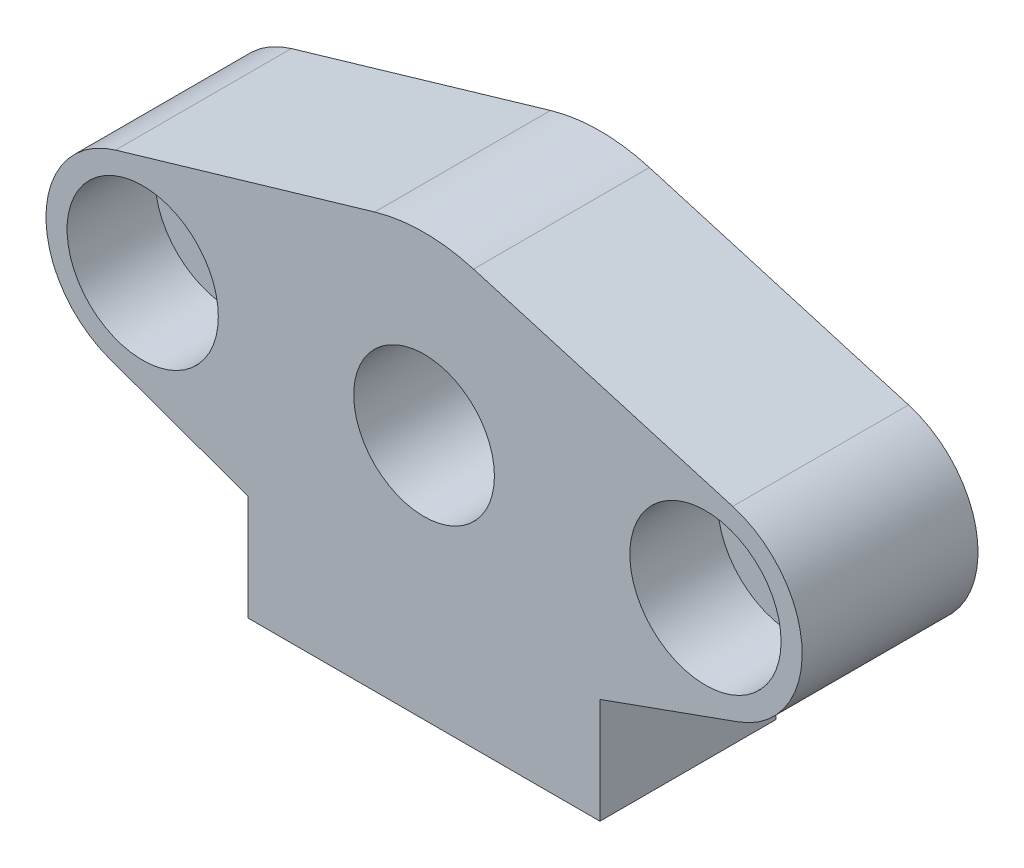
ISO-10303-21;
HEADER;
FILE_DESCRIPTION(('STEP AP214'),'2;1');
FILE_NAME('part.step','',(''),(''),'','','');
FILE_SCHEMA(('AUTOMOTIVE_DESIGN { 1 0 10303 214 1 1 1 1 }'));
ENDSEC;
DATA;
#1=APPLICATION_CONTEXT('core data for automotive mechanical design processes');
#2=APPLICATION_PROTOCOL_DEFINITION('international standard','automotive_design',2000,#1);
#3=PRODUCT_CONTEXT('',#1,'mechanical');
#4=PRODUCT('Part','Part','',(#3));
#5=PRODUCT_RELATED_PRODUCT_CATEGORY('part','',(#4));
#6=PRODUCT_DEFINITION_FORMATION('','',#4);
#7=PRODUCT_DEFINITION_CONTEXT('part definition',#1,'design');
#8=PRODUCT_DEFINITION('design','',#6,#7);
#9=PRODUCT_DEFINITION_SHAPE('','',#8);
#10=(LENGTH_UNIT() NAMED_UNIT(*) SI_UNIT(.MILLI.,.METRE.));
#11=(NAMED_UNIT(*) PLANE_ANGLE_UNIT() SI_UNIT($,.RADIAN.));
#12=(NAMED_UNIT(*) SI_UNIT($,.STERADIAN.) SOLID_ANGLE_UNIT());
#13=UNCERTAINTY_MEASURE_WITH_UNIT(LENGTH_MEASURE(1.E-05),#10,'distance_accuracy_value','');
#14=(GEOMETRIC_REPRESENTATION_CONTEXT(3) GLOBAL_UNCERTAINTY_ASSIGNED_CONTEXT((#13)) GLOBAL_UNIT_ASSIGNED_CONTEXT((#10,
#11,#12)) REPRESENTATION_CONTEXT('',''));
#15=CARTESIAN_POINT('',(0.,0.,0.));
#16=DIRECTION('',(0.,0.,1.));
#17=DIRECTION('',(1.,0.,0.));
#18=AXIS2_PLACEMENT_3D('',#15,#16,#17);
#19=CARTESIAN_POINT('',(-16.,0.,10.));
#20=DIRECTION('',(0.,0.,-1.));
#21=DIRECTION('',(-1.,0.,0.));
#22=AXIS2_PLACEMENT_3D('',#19,#20,#21);
#23=CYLINDRICAL_SURFACE('',#22,2.5);
#24=CARTESIAN_POINT('',(-16.,0.,0.));
#25=DIRECTION('',(0.,0.,1.));
#26=DIRECTION('',(1.,0.,0.));
#27=AXIS2_PLACEMENT_3D('',#24,#25,#26);
#28=CIRCLE('',#27,2.5);
#29=CARTESIAN_POINT('',(-13.5,0.,0.));
#30=VERTEX_POINT('',#29);
#31=EDGE_CURVE('E240',#30,#30,#28,.T.);
#32=ORIENTED_EDGE('',*,*,#31,.F.);
#33=EDGE_LOOP('',(#32));
#34=FACE_BOUND('',#33,.T.);
#35=CARTESIAN_POINT('',(-16.,0.,5.));
#36=DIRECTION('',(0.,0.,1.));
#37=DIRECTION('',(1.,0.,0.));
#38=AXIS2_PLACEMENT_3D('',#35,#36,#37);
#39=CIRCLE('',#38,2.5);
#40=CARTESIAN_POINT('',(-13.5,0.,5.));
#41=VERTEX_POINT('',#40);
#42=EDGE_CURVE('E43',#41,#41,#39,.T.);
#43=ORIENTED_EDGE('',*,*,#42,.T.);
#44=EDGE_LOOP('',(#43));
#45=FACE_BOUND('',#44,.T.);
#46=ADVANCED_FACE('F39',(#34,#45),#23,.F.);
#47=CARTESIAN_POINT('',(16.,0.,10.));
#48=DIRECTION('',(0.,0.,-1.));
#49=DIRECTION('',(-1.,0.,0.));
#50=AXIS2_PLACEMENT_3D('',#47,#48,#49);
#51=CYLINDRICAL_SURFACE('',#50,2.5);
#52=CARTESIAN_POINT('',(16.,0.,0.));
#53=DIRECTION('',(0.,0.,1.));
#54=DIRECTION('',(-1.,0.,0.));
#55=AXIS2_PLACEMENT_3D('',#52,#53,#54);
#56=CIRCLE('',#55,2.5);
#57=CARTESIAN_POINT('',(13.5,0.,0.));
#58=VERTEX_POINT('',#57);
#59=EDGE_CURVE('E219',#58,#58,#56,.T.);
#60=ORIENTED_EDGE('',*,*,#59,.F.);
#61=EDGE_LOOP('',(#60));
#62=FACE_BOUND('',#61,.T.);
#63=CARTESIAN_POINT('',(16.,0.,5.));
#64=DIRECTION('',(0.,0.,1.));
#65=DIRECTION('',(1.,0.,0.));
#66=AXIS2_PLACEMENT_3D('',#63,#64,#65);
#67=CIRCLE('',#66,2.5);
#68=CARTESIAN_POINT('',(18.5,0.,5.));
#69=VERTEX_POINT('',#68);
#70=EDGE_CURVE('E210',#69,#69,#67,.T.);
#71=ORIENTED_EDGE('',*,*,#70,.T.);
#72=EDGE_LOOP('',(#71));
#73=FACE_BOUND('',#72,.T.);
#74=ADVANCED_FACE('F299',(#62,#73),#51,.F.);
#75=CARTESIAN_POINT('',(0.,0.,10.));
#76=DIRECTION('',(0.,0.,1.));
#77=DIRECTION('',(1.,0.,0.));
#78=AXIS2_PLACEMENT_3D('',#75,#76,#77);
#79=PLANE('',#78);
#80=CARTESIAN_POINT('',(-16.,0.,10.));
#81=DIRECTION('',(0.,0.,1.));
#82=DIRECTION('',(1.,0.,0.));
#83=AXIS2_PLACEMENT_3D('',#80,#81,#82);
#84=CIRCLE('',#83,4.3);
#85=CARTESIAN_POINT('',(-11.7,0.,10.));
#86=VERTEX_POINT('',#85);
#87=EDGE_CURVE('E221',#86,#86,#84,.T.);
#88=ORIENTED_EDGE('',*,*,#87,.F.);
#89=EDGE_LOOP('',(#88));
#90=FACE_BOUND('',#89,.T.);
#91=CARTESIAN_POINT('',(16.,0.,10.));
#92=DIRECTION('',(0.,0.,1.));
#93=DIRECTION('',(1.,0.,0.));
#94=AXIS2_PLACEMENT_3D('',#91,#92,#93);
#95=CIRCLE('',#94,4.3);
#96=CARTESIAN_POINT('',(20.3,0.,10.));
#97=VERTEX_POINT('',#96);
#98=EDGE_CURVE('E233',#97,#97,#95,.T.);
#99=ORIENTED_EDGE('',*,*,#98,.F.);
#100=EDGE_LOOP('',(#99));
#101=FACE_BOUND('',#100,.T.);
#102=CARTESIAN_POINT('',(0.,0.,10.));
#103=DIRECTION('',(0.,0.,1.));
#104=DIRECTION('',(1.,0.,0.));
#105=AXIS2_PLACEMENT_3D('',#102,#103,#104);
#106=CIRCLE('',#105,10.);
#107=CARTESIAN_POINT('',(2.8125,9.59634533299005,10.));
#108=VERTEX_POINT('',#107);
#109=CARTESIAN_POINT('',(-2.8125,9.59634533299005,10.));
#110=VERTEX_POINT('',#109);
#111=EDGE_CURVE('E185',#108,#110,#106,.T.);
#112=ORIENTED_EDGE('',*,*,#111,.T.);
#113=DIRECTION('',(-0.959634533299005,-0.28125,0.));
#114=VECTOR('',#113,1.);
#115=CARTESIAN_POINT('',(-17.546875,5.27798993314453,10.));
#116=LINE('',#115,#114);
#117=CARTESIAN_POINT('',(-17.546875,5.27798993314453,10.));
#118=VERTEX_POINT('',#117);
#119=EDGE_CURVE('E108',#110,#118,#116,.T.);
#120=ORIENTED_EDGE('',*,*,#119,.T.);
#121=CARTESIAN_POINT('',(-16.,0.,10.));
#122=DIRECTION('',(0.,0.,1.));
#123=DIRECTION('',(1.,0.,0.));
#124=AXIS2_PLACEMENT_3D('',#121,#122,#123);
#125=CIRCLE('',#124,5.5);
#126=CARTESIAN_POINT('',(-17.8597244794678,-5.17604335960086,10.));
#127=VERTEX_POINT('',#126);
#128=EDGE_CURVE('E255',#118,#127,#125,.T.);
#129=ORIENTED_EDGE('',*,*,#128,.T.);
#130=DIRECTION('',(0.941098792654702,-0.338131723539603,0.));
#131=VECTOR('',#130,1.);
#132=CARTESIAN_POINT('',(-10.,-8.,10.));
#133=LINE('',#132,#131);
#134=CARTESIAN_POINT('',(-10.,-8.,10.));
#135=VERTEX_POINT('',#134);
#136=EDGE_CURVE('E258',#127,#135,#133,.T.);
#137=ORIENTED_EDGE('',*,*,#136,.T.);
#138=DIRECTION('',(0.,-1.,0.));
#139=VECTOR('',#138,1.);
#140=CARTESIAN_POINT('',(-10.,-14.,10.));
#141=LINE('',#140,#139);
#142=CARTESIAN_POINT('',(-10.,-14.,10.));
#143=VERTEX_POINT('',#142);
#144=EDGE_CURVE('E261',#135,#143,#141,.T.);
#145=ORIENTED_EDGE('',*,*,#144,.T.);
#146=DIRECTION('',(1.,0.,0.));
#147=VECTOR('',#146,1.);
#148=CARTESIAN_POINT('',(-10.,-14.,10.));
#149=LINE('',#148,#147);
#150=CARTESIAN_POINT('',(10.,-14.,10.));
#151=VERTEX_POINT('',#150);
#152=EDGE_CURVE('E264',#143,#151,#149,.T.);
#153=ORIENTED_EDGE('',*,*,#152,.T.);
#154=DIRECTION('',(0.,1.,0.));
#155=VECTOR('',#154,1.);
#156=CARTESIAN_POINT('',(10.,-14.,10.));
#157=LINE('',#156,#155);
#158=CARTESIAN_POINT('',(10.,-8.,10.));
#159=VERTEX_POINT('',#158);
#160=EDGE_CURVE('E134',#151,#159,#157,.T.);
#161=ORIENTED_EDGE('',*,*,#160,.T.);
#162=DIRECTION('',(0.941098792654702,0.338131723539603,0.));
#163=VECTOR('',#162,1.);
#164=CARTESIAN_POINT('',(10.,-8.,10.));
#165=LINE('',#164,#163);
#166=CARTESIAN_POINT('',(17.8597244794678,-5.17604335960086,10.));
#167=VERTEX_POINT('',#166);
#168=EDGE_CURVE('E127',#159,#167,#165,.T.);
#169=ORIENTED_EDGE('',*,*,#168,.T.);
#170=CARTESIAN_POINT('',(16.,0.,10.));
#171=DIRECTION('',(0.,0.,1.));
#172=DIRECTION('',(-1.,0.,0.));
#173=AXIS2_PLACEMENT_3D('',#170,#171,#172);
#174=CIRCLE('',#173,5.5);
#175=CARTESIAN_POINT('',(17.546875,5.27798993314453,10.));
#176=VERTEX_POINT('',#175);
#177=EDGE_CURVE('E132',#167,#176,#174,.T.);
#178=ORIENTED_EDGE('',*,*,#177,.T.);
#179=DIRECTION('',(-0.959634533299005,0.28125,0.));
#180=VECTOR('',#179,1.);
#181=CARTESIAN_POINT('',(17.546875,5.27798993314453,10.));
#182=LINE('',#181,#180);
#183=EDGE_CURVE('E59',#176,#108,#182,.T.);
#184=ORIENTED_EDGE('',*,*,#183,.T.);
#185=EDGE_LOOP('',(#112,#120,#129,#137,#145,#153,#161,#169,#178,#184));
#186=FACE_BOUND('',#185,.T.);
#187=CARTESIAN_POINT('',(0.,0.,10.));
#188=DIRECTION('',(0.,0.,1.));
#189=DIRECTION('',(1.,0.,0.));
#190=AXIS2_PLACEMENT_3D('',#187,#188,#189);
#191=CIRCLE('',#190,4.);
#192=CARTESIAN_POINT('',(4.,0.,10.));
#193=VERTEX_POINT('',#192);
#194=EDGE_CURVE('E161',#193,#193,#191,.T.);
#195=ORIENTED_EDGE('',*,*,#194,.F.);
#196=EDGE_LOOP('',(#195));
#197=FACE_BOUND('',#196,.T.);
#198=ADVANCED_FACE('F129',(#90,#101,#186,#197),#79,.T.);
#199=CARTESIAN_POINT('',(0.,0.,0.));
#200=DIRECTION('',(0.,0.,1.));
#201=DIRECTION('',(1.,0.,0.));
#202=AXIS2_PLACEMENT_3D('',#199,#200,#201);
#203=PLANE('',#202);
#204=CARTESIAN_POINT('',(0.,0.,0.));
#205=DIRECTION('',(0.,0.,1.));
#206=DIRECTION('',(1.,0.,0.));
#207=AXIS2_PLACEMENT_3D('',#204,#205,#206);
#208=CIRCLE('',#207,10.);
#209=CARTESIAN_POINT('',(2.8125,9.59634533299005,0.));
#210=VERTEX_POINT('',#209);
#211=CARTESIAN_POINT('',(-2.8125,9.59634533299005,0.));
#212=VERTEX_POINT('',#211);
#213=EDGE_CURVE('E156',#210,#212,#208,.T.);
#214=ORIENTED_EDGE('',*,*,#213,.F.);
#215=DIRECTION('',(-0.959634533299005,0.28125,0.));
#216=VECTOR('',#215,1.);
#217=CARTESIAN_POINT('',(17.546875,5.27798993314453,0.));
#218=LINE('',#217,#216);
#219=CARTESIAN_POINT('',(17.546875,5.27798993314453,0.));
#220=VERTEX_POINT('',#219);
#221=EDGE_CURVE('E100',#220,#210,#218,.T.);
#222=ORIENTED_EDGE('',*,*,#221,.F.);
#223=CARTESIAN_POINT('',(16.,0.,0.));
#224=DIRECTION('',(0.,0.,1.));
#225=DIRECTION('',(-1.,0.,0.));
#226=AXIS2_PLACEMENT_3D('',#223,#224,#225);
#227=CIRCLE('',#226,5.5);
#228=CARTESIAN_POINT('',(17.8597244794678,-5.17604335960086,0.));
#229=VERTEX_POINT('',#228);
#230=EDGE_CURVE('E94',#229,#220,#227,.T.);
#231=ORIENTED_EDGE('',*,*,#230,.F.);
#232=DIRECTION('',(0.941098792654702,0.338131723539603,0.));
#233=VECTOR('',#232,1.);
#234=CARTESIAN_POINT('',(10.,-8.,0.));
#235=LINE('',#234,#233);
#236=CARTESIAN_POINT('',(10.,-8.,0.));
#237=VERTEX_POINT('',#236);
#238=EDGE_CURVE('E143',#237,#229,#235,.T.);
#239=ORIENTED_EDGE('',*,*,#238,.F.);
#240=DIRECTION('',(0.,1.,0.));
#241=VECTOR('',#240,1.);
#242=CARTESIAN_POINT('',(10.,-14.,0.));
#243=LINE('',#242,#241);
#244=CARTESIAN_POINT('',(10.,-14.,0.));
#245=VERTEX_POINT('',#244);
#246=EDGE_CURVE('E176',#245,#237,#243,.T.);
#247=ORIENTED_EDGE('',*,*,#246,.F.);
#248=DIRECTION('',(1.,0.,0.));
#249=VECTOR('',#248,1.);
#250=CARTESIAN_POINT('',(-10.,-14.,0.));
#251=LINE('',#250,#249);
#252=CARTESIAN_POINT('',(-10.,-14.,0.));
#253=VERTEX_POINT('',#252);
#254=EDGE_CURVE('E173',#253,#245,#251,.T.);
#255=ORIENTED_EDGE('',*,*,#254,.F.);
#256=DIRECTION('',(0.,-1.,0.));
#257=VECTOR('',#256,1.);
#258=CARTESIAN_POINT('',(-10.,-14.,0.));
#259=LINE('',#258,#257);
#260=CARTESIAN_POINT('',(-10.,-8.,0.));
#261=VERTEX_POINT('',#260);
#262=EDGE_CURVE('E170',#261,#253,#259,.T.);
#263=ORIENTED_EDGE('',*,*,#262,.F.);
#264=DIRECTION('',(0.941098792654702,-0.338131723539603,0.));
#265=VECTOR('',#264,1.);
#266=CARTESIAN_POINT('',(-10.,-8.,0.));
#267=LINE('',#266,#265);
#268=CARTESIAN_POINT('',(-17.8597244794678,-5.17604335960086,0.));
#269=VERTEX_POINT('',#268);
#270=EDGE_CURVE('E167',#269,#261,#267,.T.);
#271=ORIENTED_EDGE('',*,*,#270,.F.);
#272=CARTESIAN_POINT('',(-16.,0.,0.));
#273=DIRECTION('',(0.,0.,1.));
#274=DIRECTION('',(1.,0.,0.));
#275=AXIS2_PLACEMENT_3D('',#272,#273,#274);
#276=CIRCLE('',#275,5.5);
#277=CARTESIAN_POINT('',(-17.546875,5.27798993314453,0.));
#278=VERTEX_POINT('',#277);
#279=EDGE_CURVE('E164',#278,#269,#276,.T.);
#280=ORIENTED_EDGE('',*,*,#279,.F.);
#281=DIRECTION('',(-0.959634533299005,-0.28125,0.));
#282=VECTOR('',#281,1.);
#283=CARTESIAN_POINT('',(-17.546875,5.27798993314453,0.));
#284=LINE('',#283,#282);
#285=EDGE_CURVE('E160',#212,#278,#284,.T.);
#286=ORIENTED_EDGE('',*,*,#285,.F.);
#287=EDGE_LOOP('',(#214,#222,#231,#239,#247,#255,#263,#271,#280,#286));
#288=FACE_BOUND('',#287,.T.);
#289=CARTESIAN_POINT('',(0.,0.,0.));
#290=DIRECTION('',(0.,0.,1.));
#291=DIRECTION('',(1.,0.,0.));
#292=AXIS2_PLACEMENT_3D('',#289,#290,#291);
#293=CIRCLE('',#292,4.);
#294=CARTESIAN_POINT('',(4.,0.,0.));
#295=VERTEX_POINT('',#294);
#296=EDGE_CURVE('E244',#295,#295,#293,.T.);
#297=ORIENTED_EDGE('',*,*,#296,.T.);
#298=EDGE_LOOP('',(#297));
#299=FACE_BOUND('',#298,.T.);
#300=ORIENTED_EDGE('',*,*,#31,.T.);
#301=EDGE_LOOP('',(#300));
#302=FACE_BOUND('',#301,.T.);
#303=ORIENTED_EDGE('',*,*,#59,.T.);
#304=EDGE_LOOP('',(#303));
#305=FACE_BOUND('',#304,.T.);
#306=ADVANCED_FACE('F279',(#288,#299,#302,#305),#203,.F.);
#307=CARTESIAN_POINT('',(0.,0.,10.));
#308=DIRECTION('',(0.,0.,-1.));
#309=DIRECTION('',(-1.,0.,0.));
#310=AXIS2_PLACEMENT_3D('',#307,#308,#309);
#311=CYLINDRICAL_SURFACE('',#310,10.);
#312=ORIENTED_EDGE('',*,*,#213,.T.);
#313=DIRECTION('',(0.,0.,-1.));
#314=VECTOR('',#313,1.);
#315=CARTESIAN_POINT('',(-2.8125,9.59634533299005,10.));
#316=LINE('',#315,#314);
#317=EDGE_CURVE('E11',#110,#212,#316,.T.);
#318=ORIENTED_EDGE('',*,*,#317,.F.);
#319=ORIENTED_EDGE('',*,*,#111,.F.);
#320=DIRECTION('',(0.,0.,-1.));
#321=VECTOR('',#320,1.);
#322=CARTESIAN_POINT('',(2.8125,9.59634533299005,10.));
#323=LINE('',#322,#321);
#324=EDGE_CURVE('E152',#108,#210,#323,.T.);
#325=ORIENTED_EDGE('',*,*,#324,.T.);
#326=EDGE_LOOP('',(#312,#318,#319,#325));
#327=FACE_BOUND('',#326,.T.);
#328=ADVANCED_FACE('F41',(#327),#311,.T.);
#329=CARTESIAN_POINT('',(-17.546875,5.27798993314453,10.));
#330=DIRECTION('',(0.28125,-0.959634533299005,0.));
#331=DIRECTION('',(0.959634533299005,0.28125,0.));
#332=AXIS2_PLACEMENT_3D('',#329,#330,#331);
#333=PLANE('',#332);
#334=ORIENTED_EDGE('',*,*,#285,.T.);
#335=DIRECTION('',(0.,0.,-1.));
#336=VECTOR('',#335,1.);
#337=CARTESIAN_POINT('',(-17.546875,5.27798993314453,10.));
#338=LINE('',#337,#336);
#339=EDGE_CURVE('E50',#118,#278,#338,.T.);
#340=ORIENTED_EDGE('',*,*,#339,.F.);
#341=ORIENTED_EDGE('',*,*,#119,.F.);
#342=ORIENTED_EDGE('',*,*,#317,.T.);
#343=EDGE_LOOP('',(#334,#340,#341,#342));
#344=FACE_BOUND('',#343,.T.);
#345=ADVANCED_FACE('F317',(#344),#333,.F.);
#346=CARTESIAN_POINT('',(-16.,0.,10.));
#347=DIRECTION('',(0.,0.,-1.));
#348=DIRECTION('',(-1.,0.,0.));
#349=AXIS2_PLACEMENT_3D('',#346,#347,#348);
#350=CYLINDRICAL_SURFACE('',#349,5.5);
#351=ORIENTED_EDGE('',*,*,#279,.T.);
#352=DIRECTION('',(0.,0.,-1.));
#353=VECTOR('',#352,1.);
#354=CARTESIAN_POINT('',(-17.8597244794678,-5.17604335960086,10.));
#355=LINE('',#354,#353);
#356=EDGE_CURVE('E204',#127,#269,#355,.T.);
#357=ORIENTED_EDGE('',*,*,#356,.F.);
#358=ORIENTED_EDGE('',*,*,#128,.F.);
#359=ORIENTED_EDGE('',*,*,#339,.T.);
#360=EDGE_LOOP('',(#351,#357,#358,#359));
#361=FACE_BOUND('',#360,.T.);
#362=ADVANCED_FACE('F321',(#361),#350,.T.);
#363=CARTESIAN_POINT('',(-10.,-8.,10.));
#364=DIRECTION('',(0.338131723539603,0.941098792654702,0.));
#365=DIRECTION('',(-0.941098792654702,0.338131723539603,0.));
#366=AXIS2_PLACEMENT_3D('',#363,#364,#365);
#367=PLANE('',#366);
#368=ORIENTED_EDGE('',*,*,#270,.T.);
#369=DIRECTION('',(0.,0.,-1.));
#370=VECTOR('',#369,1.);
#371=CARTESIAN_POINT('',(-10.,-8.,10.));
#372=LINE('',#371,#370);
#373=EDGE_CURVE('E200',#135,#261,#372,.T.);
#374=ORIENTED_EDGE('',*,*,#373,.F.);
#375=ORIENTED_EDGE('',*,*,#136,.F.);
#376=ORIENTED_EDGE('',*,*,#356,.T.);
#377=EDGE_LOOP('',(#368,#374,#375,#376));
#378=FACE_BOUND('',#377,.T.);
#379=ADVANCED_FACE('F325',(#378),#367,.F.);
#380=CARTESIAN_POINT('',(-10.,-14.,10.));
#381=DIRECTION('',(1.,0.,0.));
#382=DIRECTION('',(0.,0.,-1.));
#383=AXIS2_PLACEMENT_3D('',#380,#381,#382);
#384=PLANE('',#383);
#385=ORIENTED_EDGE('',*,*,#262,.T.);
#386=DIRECTION('',(0.,0.,-1.));
#387=VECTOR('',#386,1.);
#388=CARTESIAN_POINT('',(-10.,-14.,10.));
#389=LINE('',#388,#387);
#390=EDGE_CURVE('E196',#143,#253,#389,.T.);
#391=ORIENTED_EDGE('',*,*,#390,.F.);
#392=ORIENTED_EDGE('',*,*,#144,.F.);
#393=ORIENTED_EDGE('',*,*,#373,.T.);
#394=EDGE_LOOP('',(#385,#391,#392,#393));
#395=FACE_BOUND('',#394,.T.);
#396=ADVANCED_FACE('F331',(#395),#384,.F.);
#397=CARTESIAN_POINT('',(-10.,-14.,10.));
#398=DIRECTION('',(0.,1.,0.));
#399=DIRECTION('',(0.,0.,1.));
#400=AXIS2_PLACEMENT_3D('',#397,#398,#399);
#401=PLANE('',#400);
#402=ORIENTED_EDGE('',*,*,#254,.T.);
#403=DIRECTION('',(0.,0.,-1.));
#404=VECTOR('',#403,1.);
#405=CARTESIAN_POINT('',(10.,-14.,10.));
#406=LINE('',#405,#404);
#407=EDGE_CURVE('E192',#151,#245,#406,.T.);
#408=ORIENTED_EDGE('',*,*,#407,.F.);
#409=ORIENTED_EDGE('',*,*,#152,.F.);
#410=ORIENTED_EDGE('',*,*,#390,.T.);
#411=EDGE_LOOP('',(#402,#408,#409,#410));
#412=FACE_BOUND('',#411,.T.);
#413=ADVANCED_FACE('F272',(#412),#401,.F.);
#414=CARTESIAN_POINT('',(10.,-14.,10.));
#415=DIRECTION('',(-1.,0.,0.));
#416=DIRECTION('',(0.,0.,1.));
#417=AXIS2_PLACEMENT_3D('',#414,#415,#416);
#418=PLANE('',#417);
#419=ORIENTED_EDGE('',*,*,#246,.T.);
#420=DIRECTION('',(0.,0.,-1.));
#421=VECTOR('',#420,1.);
#422=CARTESIAN_POINT('',(10.,-8.,10.));
#423=LINE('',#422,#421);
#424=EDGE_CURVE('E145',#159,#237,#423,.T.);
#425=ORIENTED_EDGE('',*,*,#424,.F.);
#426=ORIENTED_EDGE('',*,*,#160,.F.);
#427=ORIENTED_EDGE('',*,*,#407,.T.);
#428=EDGE_LOOP('',(#419,#425,#426,#427));
#429=FACE_BOUND('',#428,.T.);
#430=ADVANCED_FACE('F276',(#429),#418,.F.);
#431=CARTESIAN_POINT('',(10.,-8.,10.));
#432=DIRECTION('',(-0.338131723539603,0.941098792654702,0.));
#433=DIRECTION('',(-0.941098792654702,-0.338131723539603,0.));
#434=AXIS2_PLACEMENT_3D('',#431,#432,#433);
#435=PLANE('',#434);
#436=ORIENTED_EDGE('',*,*,#238,.T.);
#437=DIRECTION('',(0.,0.,-1.));
#438=VECTOR('',#437,1.);
#439=CARTESIAN_POINT('',(17.8597244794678,-5.17604335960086,10.));
#440=LINE('',#439,#438);
#441=EDGE_CURVE('E140',#167,#229,#440,.T.);
#442=ORIENTED_EDGE('',*,*,#441,.F.);
#443=ORIENTED_EDGE('',*,*,#168,.F.);
#444=ORIENTED_EDGE('',*,*,#424,.T.);
#445=EDGE_LOOP('',(#436,#442,#443,#444));
#446=FACE_BOUND('',#445,.T.);
#447=ADVANCED_FACE('F141',(#446),#435,.F.);
#448=CARTESIAN_POINT('',(16.,0.,10.));
#449=DIRECTION('',(0.,0.,-1.));
#450=DIRECTION('',(-1.,0.,0.));
#451=AXIS2_PLACEMENT_3D('',#448,#449,#450);
#452=CYLINDRICAL_SURFACE('',#451,5.5);
#453=ORIENTED_EDGE('',*,*,#230,.T.);
#454=DIRECTION('',(0.,0.,-1.));
#455=VECTOR('',#454,1.);
#456=CARTESIAN_POINT('',(17.546875,5.27798993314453,10.));
#457=LINE('',#456,#455);
#458=EDGE_CURVE('E146',#176,#220,#457,.T.);
#459=ORIENTED_EDGE('',*,*,#458,.F.);
#460=ORIENTED_EDGE('',*,*,#177,.F.);
#461=ORIENTED_EDGE('',*,*,#441,.T.);
#462=EDGE_LOOP('',(#453,#459,#460,#461));
#463=FACE_BOUND('',#462,.T.);
#464=ADVANCED_FACE('F148',(#463),#452,.T.);
#465=CARTESIAN_POINT('',(17.546875,5.27798993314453,10.));
#466=DIRECTION('',(-0.28125,-0.959634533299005,0.));
#467=DIRECTION('',(0.959634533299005,-0.28125,0.));
#468=AXIS2_PLACEMENT_3D('',#465,#466,#467);
#469=PLANE('',#468);
#470=ORIENTED_EDGE('',*,*,#221,.T.);
#471=ORIENTED_EDGE('',*,*,#324,.F.);
#472=ORIENTED_EDGE('',*,*,#183,.F.);
#473=ORIENTED_EDGE('',*,*,#458,.T.);
#474=EDGE_LOOP('',(#470,#471,#472,#473));
#475=FACE_BOUND('',#474,.T.);
#476=ADVANCED_FACE('F285',(#475),#469,.F.);
#477=CARTESIAN_POINT('',(0.,0.,10.));
#478=DIRECTION('',(0.,0.,-1.));
#479=DIRECTION('',(-1.,0.,0.));
#480=AXIS2_PLACEMENT_3D('',#477,#478,#479);
#481=CYLINDRICAL_SURFACE('',#480,4.);
#482=ORIENTED_EDGE('',*,*,#194,.T.);
#483=EDGE_LOOP('',(#482));
#484=FACE_BOUND('',#483,.T.);
#485=ORIENTED_EDGE('',*,*,#296,.F.);
#486=EDGE_LOOP('',(#485));
#487=FACE_BOUND('',#486,.T.);
#488=ADVANCED_FACE('F287',(#484,#487),#481,.F.);
#489=CARTESIAN_POINT('',(16.,0.,5.));
#490=DIRECTION('',(0.,0.,1.));
#491=DIRECTION('',(1.,0.,0.));
#492=AXIS2_PLACEMENT_3D('',#489,#490,#491);
#493=CYLINDRICAL_SURFACE('',#492,4.3);
#494=CARTESIAN_POINT('',(16.,0.,5.));
#495=DIRECTION('',(0.,0.,1.));
#496=DIRECTION('',(1.,0.,0.));
#497=AXIS2_PLACEMENT_3D('',#494,#495,#496);
#498=CIRCLE('',#497,4.3);
#499=CARTESIAN_POINT('',(20.3,0.,5.));
#500=VERTEX_POINT('',#499);
#501=EDGE_CURVE('E227',#500,#500,#498,.T.);
#502=ORIENTED_EDGE('',*,*,#501,.F.);
#503=EDGE_LOOP('',(#502));
#504=FACE_BOUND('',#503,.T.);
#505=ORIENTED_EDGE('',*,*,#98,.T.);
#506=EDGE_LOOP('',(#505));
#507=FACE_BOUND('',#506,.T.);
#508=ADVANCED_FACE('F293',(#504,#507),#493,.F.);
#509=CARTESIAN_POINT('',(16.,0.,5.));
#510=DIRECTION('',(0.,0.,1.));
#511=DIRECTION('',(1.,0.,0.));
#512=AXIS2_PLACEMENT_3D('',#509,#510,#511);
#513=PLANE('',#512);
#514=ORIENTED_EDGE('',*,*,#70,.F.);
#515=EDGE_LOOP('',(#514));
#516=FACE_BOUND('',#515,.T.);
#517=ORIENTED_EDGE('',*,*,#501,.T.);
#518=EDGE_LOOP('',(#517));
#519=FACE_BOUND('',#518,.T.);
#520=ADVANCED_FACE('F385',(#516,#519),#513,.T.);
#521=CARTESIAN_POINT('',(-16.,0.,5.));
#522=DIRECTION('',(0.,0.,1.));
#523=DIRECTION('',(1.,0.,0.));
#524=AXIS2_PLACEMENT_3D('',#521,#522,#523);
#525=CYLINDRICAL_SURFACE('',#524,4.3);
#526=CARTESIAN_POINT('',(-16.,0.,5.));
#527=DIRECTION('',(0.,0.,1.));
#528=DIRECTION('',(1.,0.,0.));
#529=AXIS2_PLACEMENT_3D('',#526,#527,#528);
#530=CIRCLE('',#529,4.3);
#531=CARTESIAN_POINT('',(-11.7,0.,5.));
#532=VERTEX_POINT('',#531);
#533=EDGE_CURVE('E213',#532,#532,#530,.T.);
#534=ORIENTED_EDGE('',*,*,#533,.F.);
#535=EDGE_LOOP('',(#534));
#536=FACE_BOUND('',#535,.T.);
#537=ORIENTED_EDGE('',*,*,#87,.T.);
#538=EDGE_LOOP('',(#537));
#539=FACE_BOUND('',#538,.T.);
#540=ADVANCED_FACE('F394',(#536,#539),#525,.F.);
#541=CARTESIAN_POINT('',(-16.,0.,5.));
#542=DIRECTION('',(0.,0.,1.));
#543=DIRECTION('',(1.,0.,0.));
#544=AXIS2_PLACEMENT_3D('',#541,#542,#543);
#545=PLANE('',#544);
#546=ORIENTED_EDGE('',*,*,#42,.F.);
#547=EDGE_LOOP('',(#546));
#548=FACE_BOUND('',#547,.T.);
#549=ORIENTED_EDGE('',*,*,#533,.T.);
#550=EDGE_LOOP('',(#549));
#551=FACE_BOUND('',#550,.T.);
#552=ADVANCED_FACE('F404',(#548,#551),#545,.T.);
#553=CLOSED_SHELL('',(#46,#74,#198,#306,#328,#345,#362,#379,#396,#413,#430,#447,#464,#476,#488,
#508,#520,#540,#552));
#554=MANIFOLD_SOLID_BREP('B2',#553);
#555=ADVANCED_BREP_SHAPE_REPRESENTATION('',(#18,#554),#14);
#556=SHAPE_DEFINITION_REPRESENTATION(#9,#555);
ENDSEC;
END-ISO-10303-21;
